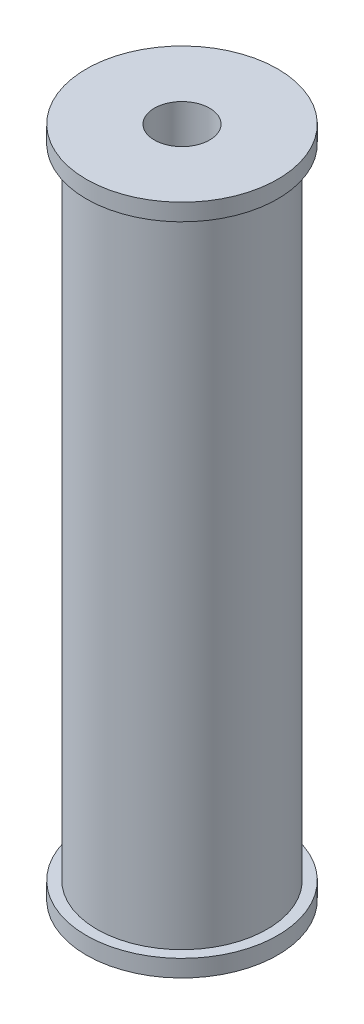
from build123d import *

# Parameters (mm, degrees)
SKETCH1_R          = 14.2875
EXTRUDE1_DEPTH     = 2.54
SKETCH2_R          = 12.7
EXTRUDE2_DEPTH     = 95.25
SKETCH3_R          = 14.2875
EXTRUDE3_DEPTH     = 2.54
SKETCH4_R          = 4.1275
CUT_EXTRUDE1_DEPTH = 103.344390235


with BuildPart() as part:
    # Sketch1 → Extrude1 (new body)
    with BuildSketch(Plane(origin=(0, 0, 0), x_dir=(1, 0, 0), z_dir=(0, 1, 0))):
        with Locations(Location((0, 0, 0), (0, 0, 270))):
            Circle(SKETCH1_R)
    extrude(amount=EXTRUDE1_DEPTH)

    # Sketch2 → Extrude2 (add)
    with BuildSketch(Plane(origin=(0, 2.54, 0), x_dir=(-1, 0, 0), z_dir=(0, 1, 0))):
        with Locations(Location((0, 0, 0), (0, 0, 90))):
            Circle(SKETCH2_R)
    extrude(amount=EXTRUDE2_DEPTH)

    # Sketch3 → Extrude3 (add)
    with BuildSketch(Plane(origin=(0, 97.79, 0), x_dir=(-1, 0, 0), z_dir=(0, 1, 0))):
        with Locations(Location((0, 0, 0), (0, 0, 90))):
            Circle(SKETCH3_R)
    extrude(amount=EXTRUDE3_DEPTH)

    # Sketch4 → Cut-Extrude1 (cut, through all)
    with BuildSketch(Plane(origin=(0, 100.33, 0), x_dir=(-1, 0, 0), z_dir=(0, 1, 0))):
        with Locations(Location((0, 0, 0), (0, 0, 90))):
            Circle(SKETCH4_R)
    extrude(amount=-CUT_EXTRUDE1_DEPTH, mode=Mode.SUBTRACT)


solid = part.part
